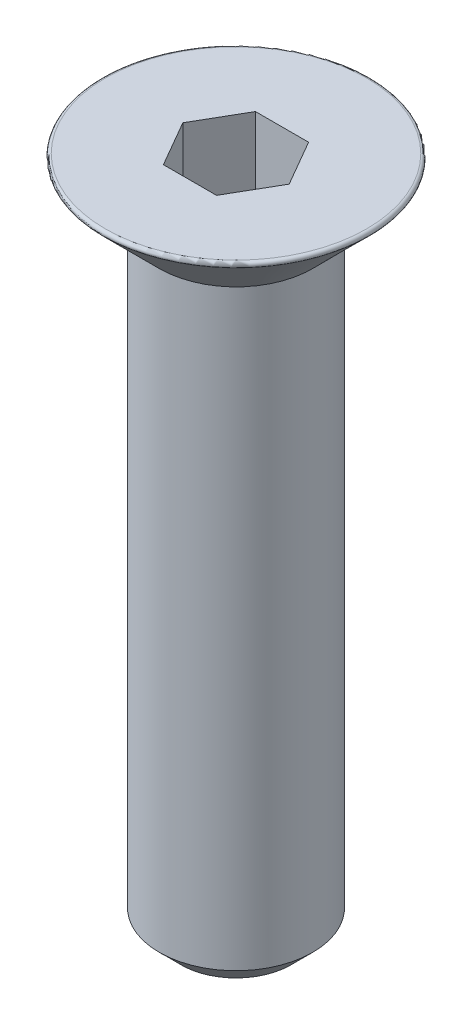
ISO-10303-21;
HEADER;
FILE_DESCRIPTION(('STEP AP214'),'2;1');
FILE_NAME('part.step','',(''),(''),'','','');
FILE_SCHEMA(('AUTOMOTIVE_DESIGN { 1 0 10303 214 1 1 1 1 }'));
ENDSEC;
DATA;
#1=APPLICATION_CONTEXT('core data for automotive mechanical design processes');
#2=APPLICATION_PROTOCOL_DEFINITION('international standard','automotive_design',2000,#1);
#3=PRODUCT_CONTEXT('',#1,'mechanical');
#4=PRODUCT('Part','Part','',(#3));
#5=PRODUCT_RELATED_PRODUCT_CATEGORY('part','',(#4));
#6=PRODUCT_DEFINITION_FORMATION('','',#4);
#7=PRODUCT_DEFINITION_CONTEXT('part definition',#1,'design');
#8=PRODUCT_DEFINITION('design','',#6,#7);
#9=PRODUCT_DEFINITION_SHAPE('','',#8);
#10=(LENGTH_UNIT() NAMED_UNIT(*) SI_UNIT(.MILLI.,.METRE.));
#11=(NAMED_UNIT(*) PLANE_ANGLE_UNIT() SI_UNIT($,.RADIAN.));
#12=(NAMED_UNIT(*) SI_UNIT($,.STERADIAN.) SOLID_ANGLE_UNIT());
#13=UNCERTAINTY_MEASURE_WITH_UNIT(LENGTH_MEASURE(1.E-05),#10,'distance_accuracy_value','');
#14=(GEOMETRIC_REPRESENTATION_CONTEXT(3) GLOBAL_UNCERTAINTY_ASSIGNED_CONTEXT((#13)) GLOBAL_UNIT_ASSIGNED_CONTEXT((#10,
#11,#12)) REPRESENTATION_CONTEXT('',''));
#15=CARTESIAN_POINT('',(0.,0.,0.));
#16=DIRECTION('',(0.,0.,1.));
#17=DIRECTION('',(1.,0.,0.));
#18=AXIS2_PLACEMENT_3D('',#15,#16,#17);
#19=CARTESIAN_POINT('',(0.,0.,0.));
#20=DIRECTION('',(0.,1.,0.));
#21=DIRECTION('',(0.,0.,1.));
#22=AXIS2_PLACEMENT_3D('',#19,#20,#21);
#23=PLANE('',#22);
#24=DIRECTION('',(0.5,0.,-0.866025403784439));
#25=VECTOR('',#24,1.);
#26=CARTESIAN_POINT('',(0.866025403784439,0.,1.5));
#27=LINE('',#26,#25);
#28=CARTESIAN_POINT('',(0.866025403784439,0.,1.5));
#29=VERTEX_POINT('',#28);
#30=CARTESIAN_POINT('',(1.73205080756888,0.,0.));
#31=VERTEX_POINT('',#30);
#32=EDGE_CURVE('E49',#29,#31,#27,.T.);
#33=ORIENTED_EDGE('',*,*,#32,.F.);
#34=DIRECTION('',(1.,0.,0.));
#35=VECTOR('',#34,1.);
#36=CARTESIAN_POINT('',(-0.866025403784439,0.,1.5));
#37=LINE('',#36,#35);
#38=CARTESIAN_POINT('',(-0.866025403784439,0.,1.5));
#39=VERTEX_POINT('',#38);
#40=EDGE_CURVE('E132',#39,#29,#37,.T.);
#41=ORIENTED_EDGE('',*,*,#40,.F.);
#42=DIRECTION('',(0.5,0.,0.866025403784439));
#43=VECTOR('',#42,1.);
#44=CARTESIAN_POINT('',(-1.73205080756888,0.,0.));
#45=LINE('',#44,#43);
#46=CARTESIAN_POINT('',(-1.73205080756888,0.,0.));
#47=VERTEX_POINT('',#46);
#48=EDGE_CURVE('E130',#47,#39,#45,.T.);
#49=ORIENTED_EDGE('',*,*,#48,.F.);
#50=DIRECTION('',(-0.5,0.,0.866025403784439));
#51=VECTOR('',#50,1.);
#52=CARTESIAN_POINT('',(-0.866025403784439,0.,-1.5));
#53=LINE('',#52,#51);
#54=CARTESIAN_POINT('',(-0.866025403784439,0.,-1.5));
#55=VERTEX_POINT('',#54);
#56=EDGE_CURVE('E97',#55,#47,#53,.T.);
#57=ORIENTED_EDGE('',*,*,#56,.F.);
#58=DIRECTION('',(-1.,0.,0.));
#59=VECTOR('',#58,1.);
#60=CARTESIAN_POINT('',(0.866025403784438,0.,-1.5));
#61=LINE('',#60,#59);
#62=CARTESIAN_POINT('',(0.866025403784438,0.,-1.5));
#63=VERTEX_POINT('',#62);
#64=EDGE_CURVE('E126',#63,#55,#61,.T.);
#65=ORIENTED_EDGE('',*,*,#64,.F.);
#66=DIRECTION('',(-0.5,0.,-0.866025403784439));
#67=VECTOR('',#66,1.);
#68=CARTESIAN_POINT('',(1.73205080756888,0.,0.));
#69=LINE('',#68,#67);
#70=EDGE_CURVE('E123',#31,#63,#69,.T.);
#71=ORIENTED_EDGE('',*,*,#70,.F.);
#72=EDGE_LOOP('',(#33,#41,#49,#57,#65,#71));
#73=FACE_BOUND('',#72,.T.);
#74=CARTESIAN_POINT('',(0.,0.,0.));
#75=DIRECTION('',(0.,1.,0.));
#76=DIRECTION('',(0.,0.,1.));
#77=AXIS2_PLACEMENT_3D('',#74,#75,#76);
#78=CIRCLE('',#77,4.25857864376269);
#79=CARTESIAN_POINT('',(0.,0.,4.25857864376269));
#80=VERTEX_POINT('',#79);
#81=EDGE_CURVE('E144',#80,#80,#78,.T.);
#82=ORIENTED_EDGE('',*,*,#81,.T.);
#83=EDGE_LOOP('',(#82));
#84=FACE_BOUND('',#83,.T.);
#85=ADVANCED_FACE('F34',(#73,#84),#23,.T.);
#86=CARTESIAN_POINT('',(0.,0.,0.));
#87=DIRECTION('',(0.,1.,0.));
#88=DIRECTION('',(0.,0.,1.));
#89=AXIS2_PLACEMENT_3D('',#86,#87,#88);
#90=CONICAL_SURFACE('',#89,4.5,0.78539816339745);
#91=CARTESIAN_POINT('',(0.,-0.170710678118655,0.));
#92=DIRECTION('',(0.,-1.,0.));
#93=DIRECTION('',(0.,0.,-1.));
#94=AXIS2_PLACEMENT_3D('',#91,#92,#93);
#95=CIRCLE('',#94,4.32928932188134);
#96=CARTESIAN_POINT('',(0.,-0.170710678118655,-4.32928932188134));
#97=VERTEX_POINT('',#96);
#98=EDGE_CURVE('E147',#97,#97,#95,.T.);
#99=ORIENTED_EDGE('',*,*,#98,.T.);
#100=EDGE_LOOP('',(#99));
#101=FACE_BOUND('',#100,.T.);
#102=CARTESIAN_POINT('',(0.,-1.99999999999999,0.));
#103=DIRECTION('',(0.,1.,0.));
#104=DIRECTION('',(0.,0.,1.));
#105=AXIS2_PLACEMENT_3D('',#102,#103,#104);
#106=CIRCLE('',#105,2.5);
#107=CARTESIAN_POINT('',(0.,-1.99999999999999,2.5));
#108=VERTEX_POINT('',#107);
#109=EDGE_CURVE('E136',#108,#108,#106,.T.);
#110=ORIENTED_EDGE('',*,*,#109,.T.);
#111=EDGE_LOOP('',(#110));
#112=FACE_BOUND('',#111,.T.);
#113=ADVANCED_FACE('F169',(#101,#112),#90,.T.);
#114=CARTESIAN_POINT('',(0.,15.4879719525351,0.));
#115=DIRECTION('',(0.,1.,0.));
#116=DIRECTION('',(0.,0.,1.));
#117=AXIS2_PLACEMENT_3D('',#114,#115,#116);
#118=CYLINDRICAL_SURFACE('',#117,2.5);
#119=CARTESIAN_POINT('',(0.,-21.3,0.));
#120=DIRECTION('',(0.,-1.,0.));
#121=DIRECTION('',(0.,0.,-1.));
#122=AXIS2_PLACEMENT_3D('',#119,#120,#121);
#123=CIRCLE('',#122,2.5);
#124=CARTESIAN_POINT('',(0.,-21.3,-2.5));
#125=VERTEX_POINT('',#124);
#126=EDGE_CURVE('E42',#125,#125,#123,.F.);
#127=ORIENTED_EDGE('',*,*,#126,.T.);
#128=EDGE_LOOP('',(#127));
#129=FACE_BOUND('',#128,.T.);
#130=ORIENTED_EDGE('',*,*,#109,.F.);
#131=EDGE_LOOP('',(#130));
#132=FACE_BOUND('',#131,.T.);
#133=ADVANCED_FACE('F152',(#129,#132),#118,.T.);
#134=CARTESIAN_POINT('',(2.5,-22.,0.));
#135=DIRECTION('',(0.,-1.,0.));
#136=DIRECTION('',(0.,0.,-1.));
#137=AXIS2_PLACEMENT_3D('',#134,#135,#136);
#138=PLANE('',#137);
#139=CARTESIAN_POINT('',(0.,-22.,0.));
#140=DIRECTION('',(0.,-1.,0.));
#141=DIRECTION('',(0.,0.,-1.));
#142=AXIS2_PLACEMENT_3D('',#139,#140,#141);
#143=CIRCLE('',#142,1.79999999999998);
#144=CARTESIAN_POINT('',(0.,-22.,-1.79999999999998));
#145=VERTEX_POINT('',#144);
#146=EDGE_CURVE('E11',#145,#145,#143,.T.);
#147=ORIENTED_EDGE('',*,*,#146,.T.);
#148=EDGE_LOOP('',(#147));
#149=FACE_BOUND('',#148,.T.);
#150=ADVANCED_FACE('F165',(#149),#138,.T.);
#151=CARTESIAN_POINT('',(0.,-0.1,0.));
#152=DIRECTION('',(0.,1.,0.));
#153=DIRECTION('',(0.,0.,1.));
#154=AXIS2_PLACEMENT_3D('',#151,#152,#153);
#155=TOROIDAL_SURFACE('',#154,4.25857864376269,0.1);
#156=ORIENTED_EDGE('',*,*,#98,.F.);
#157=EDGE_LOOP('',(#156));
#158=FACE_BOUND('',#157,.T.);
#159=ORIENTED_EDGE('',*,*,#81,.F.);
#160=EDGE_LOOP('',(#159));
#161=FACE_BOUND('',#160,.T.);
#162=ADVANCED_FACE('F157',(#158,#161),#155,.T.);
#163=CARTESIAN_POINT('',(0.,-21.3,0.));
#164=DIRECTION('',(0.,1.,0.));
#165=DIRECTION('',(0.,0.,1.));
#166=AXIS2_PLACEMENT_3D('',#163,#164,#165);
#167=CONICAL_SURFACE('',#166,2.5,0.785398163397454);
#168=ORIENTED_EDGE('',*,*,#146,.F.);
#169=EDGE_LOOP('',(#168));
#170=FACE_BOUND('',#169,.T.);
#171=ORIENTED_EDGE('',*,*,#126,.F.);
#172=EDGE_LOOP('',(#171));
#173=FACE_BOUND('',#172,.T.);
#174=ADVANCED_FACE('F36',(#170,#173),#167,.T.);
#175=CARTESIAN_POINT('',(0.866025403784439,-3.,1.5));
#176=DIRECTION('',(0.866025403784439,0.,0.5));
#177=DIRECTION('',(0.5,0.,-0.866025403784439));
#178=AXIS2_PLACEMENT_3D('',#175,#176,#177);
#179=PLANE('',#178);
#180=ORIENTED_EDGE('',*,*,#32,.T.);
#181=DIRECTION('',(0.,1.,0.));
#182=VECTOR('',#181,1.);
#183=CARTESIAN_POINT('',(1.73205080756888,-3.,0.));
#184=LINE('',#183,#182);
#185=CARTESIAN_POINT('',(1.73205080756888,-3.,0.));
#186=VERTEX_POINT('',#185);
#187=EDGE_CURVE('E79',#186,#31,#184,.T.);
#188=ORIENTED_EDGE('',*,*,#187,.F.);
#189=DIRECTION('',(0.5,0.,-0.866025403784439));
#190=VECTOR('',#189,1.);
#191=CARTESIAN_POINT('',(0.866025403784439,-3.,1.5));
#192=LINE('',#191,#190);
#193=CARTESIAN_POINT('',(0.866025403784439,-3.,1.5));
#194=VERTEX_POINT('',#193);
#195=EDGE_CURVE('E134',#194,#186,#192,.T.);
#196=ORIENTED_EDGE('',*,*,#195,.F.);
#197=DIRECTION('',(0.,1.,0.));
#198=VECTOR('',#197,1.);
#199=CARTESIAN_POINT('',(0.866025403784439,-3.,1.5));
#200=LINE('',#199,#198);
#201=EDGE_CURVE('E57',#194,#29,#200,.T.);
#202=ORIENTED_EDGE('',*,*,#201,.T.);
#203=EDGE_LOOP('',(#180,#188,#196,#202));
#204=FACE_BOUND('',#203,.T.);
#205=ADVANCED_FACE('F156',(#204),#179,.F.);
#206=CARTESIAN_POINT('',(-0.866025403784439,-3.,1.5));
#207=DIRECTION('',(0.,0.,1.));
#208=DIRECTION('',(1.,0.,0.));
#209=AXIS2_PLACEMENT_3D('',#206,#207,#208);
#210=PLANE('',#209);
#211=ORIENTED_EDGE('',*,*,#40,.T.);
#212=ORIENTED_EDGE('',*,*,#201,.F.);
#213=DIRECTION('',(1.,0.,0.));
#214=VECTOR('',#213,1.);
#215=CARTESIAN_POINT('',(-0.866025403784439,-3.,1.5));
#216=LINE('',#215,#214);
#217=CARTESIAN_POINT('',(-0.866025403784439,-3.,1.5));
#218=VERTEX_POINT('',#217);
#219=EDGE_CURVE('E109',#218,#194,#216,.T.);
#220=ORIENTED_EDGE('',*,*,#219,.F.);
#221=DIRECTION('',(0.,1.,0.));
#222=VECTOR('',#221,1.);
#223=CARTESIAN_POINT('',(-0.866025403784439,-3.,1.5));
#224=LINE('',#223,#222);
#225=EDGE_CURVE('E101',#218,#39,#224,.T.);
#226=ORIENTED_EDGE('',*,*,#225,.T.);
#227=EDGE_LOOP('',(#211,#212,#220,#226));
#228=FACE_BOUND('',#227,.T.);
#229=ADVANCED_FACE('F163',(#228),#210,.F.);
#230=CARTESIAN_POINT('',(-1.73205080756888,-3.,0.));
#231=DIRECTION('',(-0.866025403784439,0.,0.5));
#232=DIRECTION('',(0.5,0.,0.866025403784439));
#233=AXIS2_PLACEMENT_3D('',#230,#231,#232);
#234=PLANE('',#233);
#235=ORIENTED_EDGE('',*,*,#48,.T.);
#236=ORIENTED_EDGE('',*,*,#225,.F.);
#237=DIRECTION('',(0.5,0.,0.866025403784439));
#238=VECTOR('',#237,1.);
#239=CARTESIAN_POINT('',(-1.73205080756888,-3.,0.));
#240=LINE('',#239,#238);
#241=CARTESIAN_POINT('',(-1.73205080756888,-3.,0.));
#242=VERTEX_POINT('',#241);
#243=EDGE_CURVE('E105',#242,#218,#240,.T.);
#244=ORIENTED_EDGE('',*,*,#243,.F.);
#245=DIRECTION('',(0.,1.,0.));
#246=VECTOR('',#245,1.);
#247=CARTESIAN_POINT('',(-1.73205080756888,-3.,0.));
#248=LINE('',#247,#246);
#249=EDGE_CURVE('E90',#242,#47,#248,.T.);
#250=ORIENTED_EDGE('',*,*,#249,.T.);
#251=EDGE_LOOP('',(#235,#236,#244,#250));
#252=FACE_BOUND('',#251,.T.);
#253=ADVANCED_FACE('F106',(#252),#234,.F.);
#254=CARTESIAN_POINT('',(-0.866025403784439,-3.,-1.5));
#255=DIRECTION('',(-0.866025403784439,0.,-0.5));
#256=DIRECTION('',(-0.5,0.,0.866025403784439));
#257=AXIS2_PLACEMENT_3D('',#254,#255,#256);
#258=PLANE('',#257);
#259=ORIENTED_EDGE('',*,*,#56,.T.);
#260=ORIENTED_EDGE('',*,*,#249,.F.);
#261=DIRECTION('',(-0.5,0.,0.866025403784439));
#262=VECTOR('',#261,1.);
#263=CARTESIAN_POINT('',(-0.866025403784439,-3.,-1.5));
#264=LINE('',#263,#262);
#265=CARTESIAN_POINT('',(-0.866025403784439,-3.,-1.5));
#266=VERTEX_POINT('',#265);
#267=EDGE_CURVE('E94',#266,#242,#264,.T.);
#268=ORIENTED_EDGE('',*,*,#267,.F.);
#269=DIRECTION('',(0.,1.,0.));
#270=VECTOR('',#269,1.);
#271=CARTESIAN_POINT('',(-0.866025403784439,-3.,-1.5));
#272=LINE('',#271,#270);
#273=EDGE_CURVE('E102',#266,#55,#272,.T.);
#274=ORIENTED_EDGE('',*,*,#273,.T.);
#275=EDGE_LOOP('',(#259,#260,#268,#274));
#276=FACE_BOUND('',#275,.T.);
#277=ADVANCED_FACE('F92',(#276),#258,.F.);
#278=CARTESIAN_POINT('',(0.866025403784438,-3.,-1.5));
#279=DIRECTION('',(0.,0.,-1.));
#280=DIRECTION('',(-1.,0.,0.));
#281=AXIS2_PLACEMENT_3D('',#278,#279,#280);
#282=PLANE('',#281);
#283=ORIENTED_EDGE('',*,*,#64,.T.);
#284=ORIENTED_EDGE('',*,*,#273,.F.);
#285=DIRECTION('',(-1.,0.,0.));
#286=VECTOR('',#285,1.);
#287=CARTESIAN_POINT('',(0.866025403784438,-3.,-1.5));
#288=LINE('',#287,#286);
#289=CARTESIAN_POINT('',(0.866025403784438,-3.,-1.5));
#290=VERTEX_POINT('',#289);
#291=EDGE_CURVE('E115',#290,#266,#288,.T.);
#292=ORIENTED_EDGE('',*,*,#291,.F.);
#293=DIRECTION('',(0.,1.,0.));
#294=VECTOR('',#293,1.);
#295=CARTESIAN_POINT('',(0.866025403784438,-3.,-1.5));
#296=LINE('',#295,#294);
#297=EDGE_CURVE('E139',#290,#63,#296,.T.);
#298=ORIENTED_EDGE('',*,*,#297,.T.);
#299=EDGE_LOOP('',(#283,#284,#292,#298));
#300=FACE_BOUND('',#299,.T.);
#301=ADVANCED_FACE('F187',(#300),#282,.F.);
#302=CARTESIAN_POINT('',(1.73205080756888,-3.,0.));
#303=DIRECTION('',(0.866025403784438,0.,-0.5));
#304=DIRECTION('',(-0.5,0.,-0.866025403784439));
#305=AXIS2_PLACEMENT_3D('',#302,#303,#304);
#306=PLANE('',#305);
#307=ORIENTED_EDGE('',*,*,#70,.T.);
#308=ORIENTED_EDGE('',*,*,#297,.F.);
#309=DIRECTION('',(-0.5,0.,-0.866025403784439));
#310=VECTOR('',#309,1.);
#311=CARTESIAN_POINT('',(1.73205080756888,-3.,0.));
#312=LINE('',#311,#310);
#313=EDGE_CURVE('E117',#186,#290,#312,.T.);
#314=ORIENTED_EDGE('',*,*,#313,.F.);
#315=ORIENTED_EDGE('',*,*,#187,.T.);
#316=EDGE_LOOP('',(#307,#308,#314,#315));
#317=FACE_BOUND('',#316,.T.);
#318=ADVANCED_FACE('F184',(#317),#306,.F.);
#319=CARTESIAN_POINT('',(1.73205080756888,-3.,0.));
#320=DIRECTION('',(0.,1.,0.));
#321=DIRECTION('',(0.,0.,1.));
#322=AXIS2_PLACEMENT_3D('',#319,#320,#321);
#323=PLANE('',#322);
#324=ORIENTED_EDGE('',*,*,#195,.T.);
#325=ORIENTED_EDGE('',*,*,#313,.T.);
#326=ORIENTED_EDGE('',*,*,#291,.T.);
#327=ORIENTED_EDGE('',*,*,#267,.T.);
#328=ORIENTED_EDGE('',*,*,#243,.T.);
#329=ORIENTED_EDGE('',*,*,#219,.T.);
#330=EDGE_LOOP('',(#324,#325,#326,#327,#328,#329));
#331=FACE_BOUND('',#330,.T.);
#332=ADVANCED_FACE('F112',(#331),#323,.T.);
#333=CLOSED_SHELL('',(#85,#113,#133,#150,#162,#174,#205,#229,#253,#277,#301,#318,#332));
#334=MANIFOLD_SOLID_BREP('B2',#333);
#335=ADVANCED_BREP_SHAPE_REPRESENTATION('',(#18,#334),#14);
#336=SHAPE_DEFINITION_REPRESENTATION(#9,#335);
ENDSEC;
END-ISO-10303-21;
